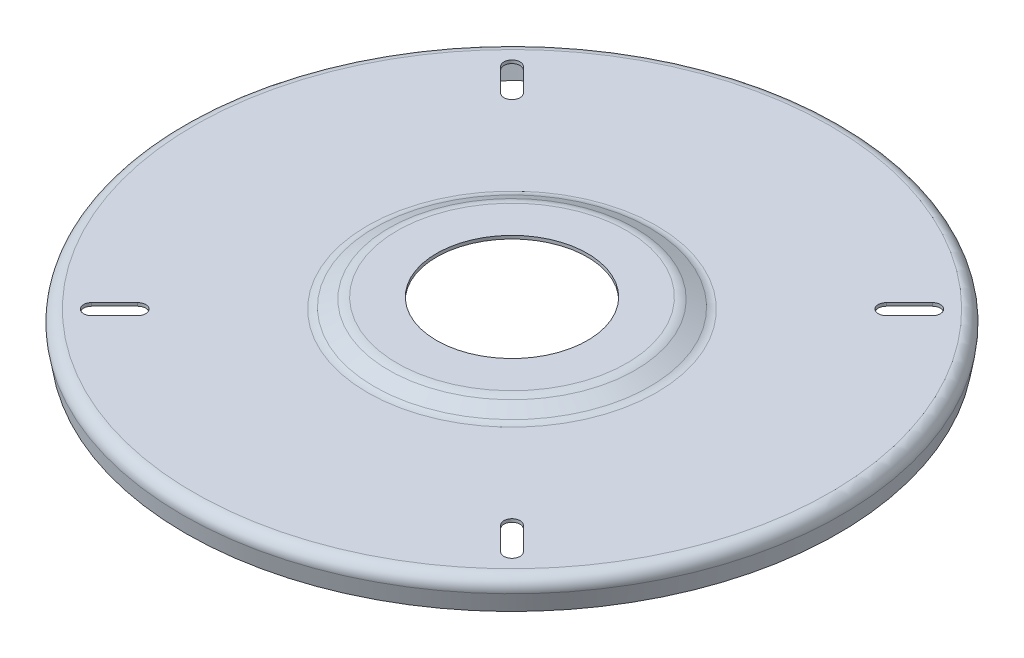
from build123d import *

# Parameters (mm, degrees)
EXTRUSION1_REACH             = 445.391
ESQUISSE2_R                  = 71.5
EXTRUSION2_REACH             = 444.612
R_P_TITION_CIRCULAIRE1_COUNT = 4


with BuildPart() as part:
    # Esquisse1 → R_volution1 (revolve)
    with BuildSketch(Plane.XY, mode=Mode.PRIVATE) as r_volution1_sk:
        with BuildLine():
            Line((0, 36.520942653), (-108.84437256, 36.520942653))
            ThreePointArc((-108.84437256, 36.520942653), (-112.218638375, 36.136493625), (-115.419939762, 35.002853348))
            Line((-115.419939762, 35.002853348), (-129.075380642, 28.342649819))
            ThreePointArc((-129.075380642, 28.342649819), (-132.916942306, 26.982281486), (-136.966061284, 26.520942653))
            Line((-136.966061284, 26.520942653), (-301.277, 26.520942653))
            ThreePointArc((-301.277, 26.520942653), (-307.405444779, 23.66320192), (-309.155576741, 17.131620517))
            Line((-309.155576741, 17.131620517), (-306.226666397, 0.520944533))
            Line((-306.226666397, 0.520944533), (-309.181089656, 0))
            Line((-309.181089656, 0), (-312.11, 16.610675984))
            ThreePointArc((-312.11, 16.610675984), (-309.703578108, 25.591564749), (-301.277, 29.520942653))
            Line((-301.277, 29.520942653), (-136.966061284, 29.520942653))
            ThreePointArc((-136.966061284, 29.520942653), (-133.591795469, 29.905391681), (-130.390494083, 31.039031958))
            Line((-130.390494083, 31.039031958), (-116.735053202, 37.699235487))
            ThreePointArc((-116.735053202, 37.699235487), (-112.893491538, 39.05960382), (-108.84437256, 39.520942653))
            Line((-108.84437256, 39.520942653), (0, 39.520942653))
            Line((0, 39.520942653), (0, 36.520942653))
        make_face()
    revolve(r_volution1_sk.sketch.rotate(Axis((0, -1.58493251, 0), (0, 1, 0)), 270), axis=Axis((0, -1.58493251, 0), (0, 1, 0)))

    # Esquisse2 → Extrusion1 (cut, up to next)
    with BuildSketch(Plane(origin=(0, 39.520942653, 0), x_dir=(1, 0, 0), z_dir=(0, 1, 0)), mode=Mode.PRIVATE) as extrusion1_sk1:
        with Locations(Location((0, 0, 0), (0, 0, 270))):
            Circle(ESQUISSE2_R)
    extrusion1_tool1 = extrude(extrusion1_sk1.sketch, amount=-EXTRUSION1_REACH, mode=Mode.PRIVATE) & part.part
    add(extrusion1_tool1.solids().sort_by_distance((0, 39.520943, 0))[0], mode=Mode.SUBTRACT)

    # Esquisse3 → Extrusion2 (cut, up to next)
    with BuildSketch(Plane(origin=(0, 29.520942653, 0), x_dir=(1, 0, 0), z_dir=(0, 1, 0)), mode=Mode.PRIVATE) as extrusion2_sk1:
        with BuildLine():
            Line((171.954227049, -182.702250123), (193.747258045, -204.495281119))
            ThreePointArc((193.747258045, -204.495281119), (204.495281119, -204.495281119), (204.495281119, -193.747258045))
            Line((204.495281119, -193.747258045), (182.702250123, -171.954227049))
            ThreePointArc((182.702250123, -171.954227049), (171.954227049, -171.954227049), (171.954227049, -182.702250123))
        make_face()
    extrusion2_tool1 = extrude(extrusion2_sk1.sketch, amount=-EXTRUSION2_REACH, mode=Mode.PRIVATE) & part.part
    extrusion2 = extrusion2_tool1.solids().sort_by_distance((188.224754, 29.520943, 188.224754))[0]
    add(extrusion2, mode=Mode.SUBTRACT)

    # R_p_tition circulaire1: Extrusion2 ×4 about axis
    r_p_tition_circulaire1_axis = Axis((0, 0, 0), (0, 1, 0))
    for i in range(1, R_P_TITION_CIRCULAIRE1_COUNT):
        add(extrusion2.rotate(r_p_tition_circulaire1_axis, i * 360 / R_P_TITION_CIRCULAIRE1_COUNT), mode=Mode.SUBTRACT)


solid = part.part
